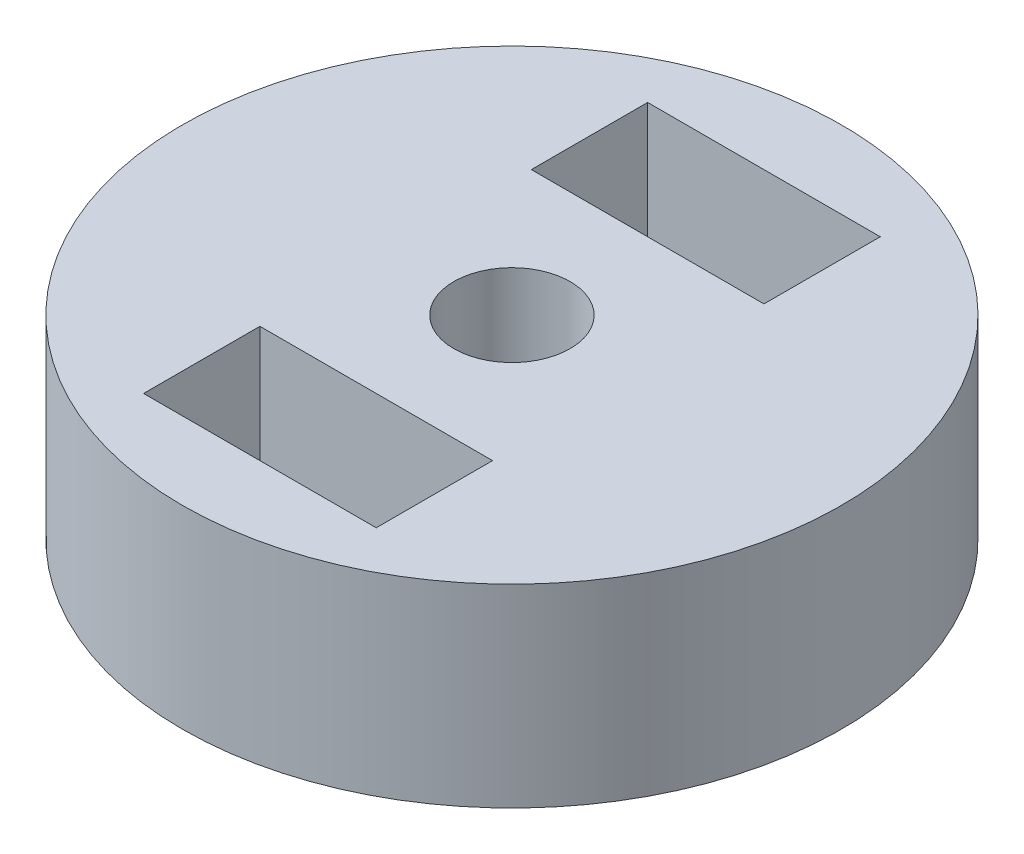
from build123d import *

# Parameters (mm, degrees)
SKETCH_1_R          = 8.5
SKETCH_1_R_2        = 1.5
EXTRUDE_1_DEPTH     = 5
SKETCH_2_W          = 6
SKETCH_2_H          = 3
CUT_EXTRUDE_1_DEPTH = 5


with BuildPart() as part:
    # Sketch 1 → Extrude 1 (new body)
    with BuildSketch(Plane(origin=(0, 0, 0), x_dir=(1, 0, 0), z_dir=(0, 1, 0))):
        with Locations(Location((0, 0, 0), (0, 0, 270))):
            Circle(SKETCH_1_R)
        with Locations(Location((0, 0, 0), (0, 0, 270))):
            Circle(SKETCH_1_R_2, mode=Mode.SUBTRACT)
    extrude(amount=EXTRUDE_1_DEPTH)

    # Sketch 2 → Cut-Extrude 1 (cut)
    with BuildSketch(Plane(origin=(0, 5, 0), x_dir=(1, 0, 0), z_dir=(0, 1, 0))):
        with Locations((0, -5)):
            Rectangle(SKETCH_2_W, SKETCH_2_H)
        with Locations((0, 5)):
            Rectangle(SKETCH_2_W, SKETCH_2_H)
    extrude(amount=-CUT_EXTRUDE_1_DEPTH, mode=Mode.SUBTRACT)


solid = part.part
